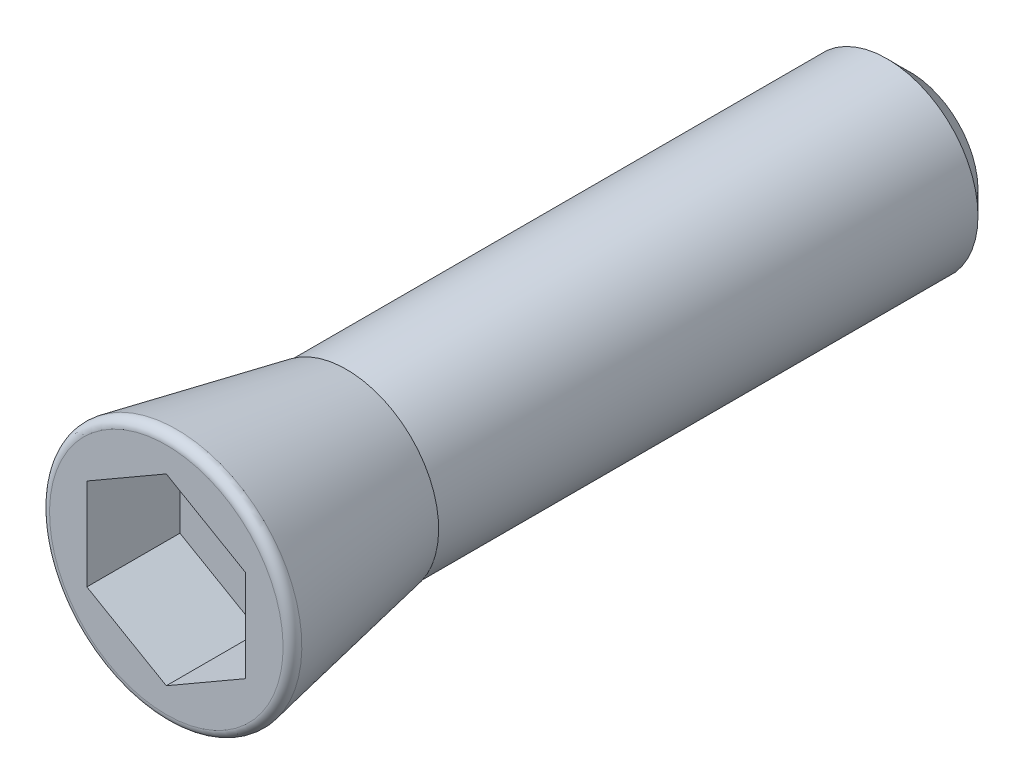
ISO-10303-21;
HEADER;
FILE_DESCRIPTION(('STEP AP214'),'2;1');
FILE_NAME('part.step','',(''),(''),'','','');
FILE_SCHEMA(('AUTOMOTIVE_DESIGN { 1 0 10303 214 1 1 1 1 }'));
ENDSEC;
DATA;
#1=APPLICATION_CONTEXT('core data for automotive mechanical design processes');
#2=APPLICATION_PROTOCOL_DEFINITION('international standard','automotive_design',2000,#1);
#3=PRODUCT_CONTEXT('',#1,'mechanical');
#4=PRODUCT('Part','Part','',(#3));
#5=PRODUCT_RELATED_PRODUCT_CATEGORY('part','',(#4));
#6=PRODUCT_DEFINITION_FORMATION('','',#4);
#7=PRODUCT_DEFINITION_CONTEXT('part definition',#1,'design');
#8=PRODUCT_DEFINITION('design','',#6,#7);
#9=PRODUCT_DEFINITION_SHAPE('','',#8);
#10=(LENGTH_UNIT() NAMED_UNIT(*) SI_UNIT(.MILLI.,.METRE.));
#11=(NAMED_UNIT(*) PLANE_ANGLE_UNIT() SI_UNIT($,.RADIAN.));
#12=(NAMED_UNIT(*) SI_UNIT($,.STERADIAN.) SOLID_ANGLE_UNIT());
#13=UNCERTAINTY_MEASURE_WITH_UNIT(LENGTH_MEASURE(1.E-05),#10,'distance_accuracy_value','');
#14=(GEOMETRIC_REPRESENTATION_CONTEXT(3) GLOBAL_UNCERTAINTY_ASSIGNED_CONTEXT((#13)) GLOBAL_UNIT_ASSIGNED_CONTEXT((#10,
#11,#12)) REPRESENTATION_CONTEXT('',''));
#15=CARTESIAN_POINT('',(0.,0.,0.));
#16=DIRECTION('',(0.,0.,1.));
#17=DIRECTION('',(1.,0.,0.));
#18=AXIS2_PLACEMENT_3D('',#15,#16,#17);
#19=CARTESIAN_POINT('',(0.,7.9375,-15.875));
#20=DIRECTION('',(0.,0.,1.));
#21=DIRECTION('',(0.,-1.,0.));
#22=AXIS2_PLACEMENT_3D('',#19,#20,#21);
#23=PLANE('',#22);
#24=CARTESIAN_POINT('',(0.,0.,-15.875));
#25=DIRECTION('',(0.,0.,1.));
#26=DIRECTION('',(0.,-1.,0.));
#27=AXIS2_PLACEMENT_3D('',#24,#25,#26);
#28=CIRCLE('',#27,8.);
#29=CARTESIAN_POINT('',(0.,-8.,-15.875));
#30=VERTEX_POINT('',#29);
#31=EDGE_CURVE('E132',#30,#30,#28,.T.);
#32=ORIENTED_EDGE('',*,*,#31,.T.);
#33=EDGE_LOOP('',(#32));
#34=FACE_BOUND('',#33,.T.);
#35=CARTESIAN_POINT('',(0.,0.,-15.875));
#36=DIRECTION('',(0.,0.,1.));
#37=DIRECTION('',(0.,-1.,0.));
#38=AXIS2_PLACEMENT_3D('',#35,#36,#37);
#39=CIRCLE('',#38,8.128);
#40=CARTESIAN_POINT('',(0.,-8.128,-15.875));
#41=VERTEX_POINT('',#40);
#42=EDGE_CURVE('E129',#41,#41,#39,.T.);
#43=ORIENTED_EDGE('',*,*,#42,.F.);
#44=EDGE_LOOP('',(#43));
#45=FACE_BOUND('',#44,.T.);
#46=ADVANCED_FACE('F14',(#34,#45),#23,.F.);
#47=CARTESIAN_POINT('',(0.,0.,-15.875));
#48=DIRECTION('',(0.,0.,1.));
#49=DIRECTION('',(0.,-1.,0.));
#50=AXIS2_PLACEMENT_3D('',#47,#48,#49);
#51=CONICAL_SURFACE('',#50,8.128,0.191986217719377);
#52=CARTESIAN_POINT('',(0.,0.,-0.907396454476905));
#53=DIRECTION('',(0.,0.,1.));
#54=DIRECTION('',(0.,-1.,0.));
#55=AXIS2_PLACEMENT_3D('',#52,#53,#54);
#56=CIRCLE('',#55,11.0374074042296);
#57=CARTESIAN_POINT('',(0.,-11.0374074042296,-0.907396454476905));
#58=VERTEX_POINT('',#57);
#59=EDGE_CURVE('E126',#58,#58,#56,.T.);
#60=ORIENTED_EDGE('',*,*,#59,.F.);
#61=EDGE_LOOP('',(#60));
#62=FACE_BOUND('',#61,.T.);
#63=ORIENTED_EDGE('',*,*,#42,.T.);
#64=EDGE_LOOP('',(#63));
#65=FACE_BOUND('',#64,.T.);
#66=ADVANCED_FACE('F149',(#62,#65),#51,.T.);
#67=CARTESIAN_POINT('',(0.,0.,-0.762000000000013));
#68=DIRECTION('',(0.,0.,1.));
#69=DIRECTION('',(0.,-1.,0.));
#70=AXIS2_PLACEMENT_3D('',#67,#68,#69);
#71=TOROIDAL_SURFACE('',#70,10.2894074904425,0.762);
#72=CARTESIAN_POINT('',(0.,0.,0.));
#73=DIRECTION('',(0.,0.,1.));
#74=DIRECTION('',(0.,-1.,0.));
#75=AXIS2_PLACEMENT_3D('',#72,#73,#74);
#76=CIRCLE('',#75,10.2894074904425);
#77=CARTESIAN_POINT('',(0.,-10.2894074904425,0.));
#78=VERTEX_POINT('',#77);
#79=EDGE_CURVE('E117',#78,#78,#76,.T.);
#80=ORIENTED_EDGE('',*,*,#79,.F.);
#81=EDGE_LOOP('',(#80));
#82=FACE_BOUND('',#81,.T.);
#83=ORIENTED_EDGE('',*,*,#59,.T.);
#84=EDGE_LOOP('',(#83));
#85=FACE_BOUND('',#84,.T.);
#86=ADVANCED_FACE('F156',(#82,#85),#71,.T.);
#87=CARTESIAN_POINT('',(0.,0.,0.));
#88=DIRECTION('',(0.,0.,-1.));
#89=DIRECTION('',(0.,1.,0.));
#90=AXIS2_PLACEMENT_3D('',#87,#88,#89);
#91=PLANE('',#90);
#92=DIRECTION('',(0.866025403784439,0.5,0.));
#93=VECTOR('',#92,1.);
#94=CARTESIAN_POINT('',(0.,-8.08290376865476,0.));
#95=LINE('',#94,#93);
#96=CARTESIAN_POINT('',(0.,-8.08290376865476,0.));
#97=VERTEX_POINT('',#96);
#98=CARTESIAN_POINT('',(7.,-4.04145188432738,0.));
#99=VERTEX_POINT('',#98);
#100=EDGE_CURVE('E83',#97,#99,#95,.T.);
#101=ORIENTED_EDGE('',*,*,#100,.F.);
#102=DIRECTION('',(0.866025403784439,-0.5,0.));
#103=VECTOR('',#102,1.);
#104=CARTESIAN_POINT('',(-7.,-4.04145188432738,0.));
#105=LINE('',#104,#103);
#106=CARTESIAN_POINT('',(-7.,-4.04145188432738,0.));
#107=VERTEX_POINT('',#106);
#108=EDGE_CURVE('E29',#107,#97,#105,.T.);
#109=ORIENTED_EDGE('',*,*,#108,.F.);
#110=DIRECTION('',(0.,-1.,0.));
#111=VECTOR('',#110,1.);
#112=CARTESIAN_POINT('',(-7.,4.04145188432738,0.));
#113=LINE('',#112,#111);
#114=CARTESIAN_POINT('',(-7.,4.04145188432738,0.));
#115=VERTEX_POINT('',#114);
#116=EDGE_CURVE('E99',#115,#107,#113,.T.);
#117=ORIENTED_EDGE('',*,*,#116,.F.);
#118=DIRECTION('',(-0.866025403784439,-0.5,0.));
#119=VECTOR('',#118,1.);
#120=CARTESIAN_POINT('',(0.,8.08290376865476,0.));
#121=LINE('',#120,#119);
#122=CARTESIAN_POINT('',(0.,8.08290376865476,0.));
#123=VERTEX_POINT('',#122);
#124=EDGE_CURVE('E93',#123,#115,#121,.T.);
#125=ORIENTED_EDGE('',*,*,#124,.F.);
#126=DIRECTION('',(-0.866025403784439,0.5,0.));
#127=VECTOR('',#126,1.);
#128=CARTESIAN_POINT('',(7.,4.04145188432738,0.));
#129=LINE('',#128,#127);
#130=CARTESIAN_POINT('',(7.,4.04145188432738,0.));
#131=VERTEX_POINT('',#130);
#132=EDGE_CURVE('E91',#131,#123,#129,.T.);
#133=ORIENTED_EDGE('',*,*,#132,.F.);
#134=DIRECTION('',(0.,1.,0.));
#135=VECTOR('',#134,1.);
#136=CARTESIAN_POINT('',(7.,-4.04145188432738,0.));
#137=LINE('',#136,#135);
#138=EDGE_CURVE('E72',#99,#131,#137,.T.);
#139=ORIENTED_EDGE('',*,*,#138,.F.);
#140=EDGE_LOOP('',(#101,#109,#117,#125,#133,#139));
#141=FACE_BOUND('',#140,.T.);
#142=ORIENTED_EDGE('',*,*,#79,.T.);
#143=EDGE_LOOP('',(#142));
#144=FACE_BOUND('',#143,.T.);
#145=ADVANCED_FACE('F87',(#141,#144),#91,.F.);
#146=CARTESIAN_POINT('',(-7.,-4.04145188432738,-8.2));
#147=DIRECTION('',(-0.5,-0.866025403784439,0.));
#148=DIRECTION('',(0.866025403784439,-0.5,0.));
#149=AXIS2_PLACEMENT_3D('',#146,#147,#148);
#150=PLANE('',#149);
#151=ORIENTED_EDGE('',*,*,#108,.T.);
#152=DIRECTION('',(0.,0.,1.));
#153=VECTOR('',#152,1.);
#154=CARTESIAN_POINT('',(0.,-8.08290376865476,-8.2));
#155=LINE('',#154,#153);
#156=CARTESIAN_POINT('',(0.,-8.08290376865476,-8.2));
#157=VERTEX_POINT('',#156);
#158=EDGE_CURVE('E80',#157,#97,#155,.T.);
#159=ORIENTED_EDGE('',*,*,#158,.F.);
#160=DIRECTION('',(0.866025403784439,-0.5,0.));
#161=VECTOR('',#160,1.);
#162=CARTESIAN_POINT('',(-7.,-4.04145188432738,-8.2));
#163=LINE('',#162,#161);
#164=CARTESIAN_POINT('',(-7.,-4.04145188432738,-8.2));
#165=VERTEX_POINT('',#164);
#166=EDGE_CURVE('E101',#165,#157,#163,.T.);
#167=ORIENTED_EDGE('',*,*,#166,.F.);
#168=DIRECTION('',(0.,0.,1.));
#169=VECTOR('',#168,1.);
#170=CARTESIAN_POINT('',(-7.,-4.04145188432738,-8.2));
#171=LINE('',#170,#169);
#172=EDGE_CURVE('E36',#165,#107,#171,.T.);
#173=ORIENTED_EDGE('',*,*,#172,.T.);
#174=EDGE_LOOP('',(#151,#159,#167,#173));
#175=FACE_BOUND('',#174,.T.);
#176=ADVANCED_FACE('F166',(#175),#150,.F.);
#177=CARTESIAN_POINT('',(-7.,4.04145188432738,-8.2));
#178=DIRECTION('',(-1.,0.,0.));
#179=DIRECTION('',(0.,-1.,0.));
#180=AXIS2_PLACEMENT_3D('',#177,#178,#179);
#181=PLANE('',#180);
#182=ORIENTED_EDGE('',*,*,#116,.T.);
#183=ORIENTED_EDGE('',*,*,#172,.F.);
#184=DIRECTION('',(0.,-1.,0.));
#185=VECTOR('',#184,1.);
#186=CARTESIAN_POINT('',(-7.,4.04145188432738,-8.2));
#187=LINE('',#186,#185);
#188=CARTESIAN_POINT('',(-7.,4.04145188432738,-8.2));
#189=VERTEX_POINT('',#188);
#190=EDGE_CURVE('E113',#189,#165,#187,.T.);
#191=ORIENTED_EDGE('',*,*,#190,.F.);
#192=DIRECTION('',(0.,0.,1.));
#193=VECTOR('',#192,1.);
#194=CARTESIAN_POINT('',(-7.,4.04145188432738,-8.2));
#195=LINE('',#194,#193);
#196=EDGE_CURVE('E118',#189,#115,#195,.T.);
#197=ORIENTED_EDGE('',*,*,#196,.T.);
#198=EDGE_LOOP('',(#182,#183,#191,#197));
#199=FACE_BOUND('',#198,.T.);
#200=ADVANCED_FACE('F169',(#199),#181,.F.);
#201=CARTESIAN_POINT('',(0.,8.08290376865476,-8.2));
#202=DIRECTION('',(-0.5,0.866025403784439,0.));
#203=DIRECTION('',(-0.866025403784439,-0.5,0.));
#204=AXIS2_PLACEMENT_3D('',#201,#202,#203);
#205=PLANE('',#204);
#206=ORIENTED_EDGE('',*,*,#124,.T.);
#207=ORIENTED_EDGE('',*,*,#196,.F.);
#208=DIRECTION('',(-0.866025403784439,-0.5,0.));
#209=VECTOR('',#208,1.);
#210=CARTESIAN_POINT('',(0.,8.08290376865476,-8.2));
#211=LINE('',#210,#209);
#212=CARTESIAN_POINT('',(0.,8.08290376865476,-8.2));
#213=VERTEX_POINT('',#212);
#214=EDGE_CURVE('E110',#213,#189,#211,.T.);
#215=ORIENTED_EDGE('',*,*,#214,.F.);
#216=DIRECTION('',(0.,0.,1.));
#217=VECTOR('',#216,1.);
#218=CARTESIAN_POINT('',(0.,8.08290376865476,-8.2));
#219=LINE('',#218,#217);
#220=EDGE_CURVE('E120',#213,#123,#219,.T.);
#221=ORIENTED_EDGE('',*,*,#220,.T.);
#222=EDGE_LOOP('',(#206,#207,#215,#221));
#223=FACE_BOUND('',#222,.T.);
#224=ADVANCED_FACE('F178',(#223),#205,.F.);
#225=CARTESIAN_POINT('',(7.,4.04145188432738,-8.2));
#226=DIRECTION('',(0.5,0.866025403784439,0.));
#227=DIRECTION('',(-0.866025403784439,0.5,0.));
#228=AXIS2_PLACEMENT_3D('',#225,#226,#227);
#229=PLANE('',#228);
#230=ORIENTED_EDGE('',*,*,#132,.T.);
#231=ORIENTED_EDGE('',*,*,#220,.F.);
#232=DIRECTION('',(-0.866025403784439,0.5,0.));
#233=VECTOR('',#232,1.);
#234=CARTESIAN_POINT('',(7.,4.04145188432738,-8.2));
#235=LINE('',#234,#233);
#236=CARTESIAN_POINT('',(7.,4.04145188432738,-8.2));
#237=VERTEX_POINT('',#236);
#238=EDGE_CURVE('E107',#237,#213,#235,.T.);
#239=ORIENTED_EDGE('',*,*,#238,.F.);
#240=DIRECTION('',(0.,0.,1.));
#241=VECTOR('',#240,1.);
#242=CARTESIAN_POINT('',(7.,4.04145188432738,-8.2));
#243=LINE('',#242,#241);
#244=EDGE_CURVE('E79',#237,#131,#243,.T.);
#245=ORIENTED_EDGE('',*,*,#244,.T.);
#246=EDGE_LOOP('',(#230,#231,#239,#245));
#247=FACE_BOUND('',#246,.T.);
#248=ADVANCED_FACE('F175',(#247),#229,.F.);
#249=CARTESIAN_POINT('',(7.,-4.04145188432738,-8.2));
#250=DIRECTION('',(1.,0.,0.));
#251=DIRECTION('',(0.,1.,0.));
#252=AXIS2_PLACEMENT_3D('',#249,#250,#251);
#253=PLANE('',#252);
#254=ORIENTED_EDGE('',*,*,#138,.T.);
#255=ORIENTED_EDGE('',*,*,#244,.F.);
#256=DIRECTION('',(0.,1.,0.));
#257=VECTOR('',#256,1.);
#258=CARTESIAN_POINT('',(7.,-4.04145188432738,-8.2));
#259=LINE('',#258,#257);
#260=CARTESIAN_POINT('',(7.,-4.04145188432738,-8.2));
#261=VERTEX_POINT('',#260);
#262=EDGE_CURVE('E75',#261,#237,#259,.T.);
#263=ORIENTED_EDGE('',*,*,#262,.F.);
#264=DIRECTION('',(0.,0.,1.));
#265=VECTOR('',#264,1.);
#266=CARTESIAN_POINT('',(7.,-4.04145188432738,-8.2));
#267=LINE('',#266,#265);
#268=EDGE_CURVE('E68',#261,#99,#267,.T.);
#269=ORIENTED_EDGE('',*,*,#268,.T.);
#270=EDGE_LOOP('',(#254,#255,#263,#269));
#271=FACE_BOUND('',#270,.T.);
#272=ADVANCED_FACE('F70',(#271),#253,.F.);
#273=CARTESIAN_POINT('',(0.,-8.08290376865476,-8.2));
#274=DIRECTION('',(0.5,-0.866025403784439,0.));
#275=DIRECTION('',(0.866025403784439,0.5,0.));
#276=AXIS2_PLACEMENT_3D('',#273,#274,#275);
#277=PLANE('',#276);
#278=ORIENTED_EDGE('',*,*,#100,.T.);
#279=ORIENTED_EDGE('',*,*,#268,.F.);
#280=DIRECTION('',(0.866025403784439,0.5,0.));
#281=VECTOR('',#280,1.);
#282=CARTESIAN_POINT('',(0.,-8.08290376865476,-8.2));
#283=LINE('',#282,#281);
#284=EDGE_CURVE('E104',#157,#261,#283,.T.);
#285=ORIENTED_EDGE('',*,*,#284,.F.);
#286=ORIENTED_EDGE('',*,*,#158,.T.);
#287=EDGE_LOOP('',(#278,#279,#285,#286));
#288=FACE_BOUND('',#287,.T.);
#289=ADVANCED_FACE('F84',(#288),#277,.F.);
#290=CARTESIAN_POINT('',(-7.,-4.04145188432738,-8.2));
#291=DIRECTION('',(0.,0.,-1.));
#292=DIRECTION('',(-1.,0.,0.));
#293=AXIS2_PLACEMENT_3D('',#290,#291,#292);
#294=PLANE('',#293);
#295=ORIENTED_EDGE('',*,*,#166,.T.);
#296=ORIENTED_EDGE('',*,*,#284,.T.);
#297=ORIENTED_EDGE('',*,*,#262,.T.);
#298=ORIENTED_EDGE('',*,*,#238,.T.);
#299=ORIENTED_EDGE('',*,*,#214,.T.);
#300=ORIENTED_EDGE('',*,*,#190,.T.);
#301=EDGE_LOOP('',(#295,#296,#297,#298,#299,#300));
#302=FACE_BOUND('',#301,.T.);
#303=ADVANCED_FACE('F172',(#302),#294,.F.);
#304=CARTESIAN_POINT('',(0.,0.,-10.532));
#305=DIRECTION('',(0.,0.,-1.));
#306=DIRECTION('',(0.,1.,0.));
#307=AXIS2_PLACEMENT_3D('',#304,#305,#306);
#308=CYLINDRICAL_SURFACE('',#307,8.);
#309=CARTESIAN_POINT('',(0.,0.,-63.532));
#310=DIRECTION('',(0.,0.,1.));
#311=DIRECTION('',(0.,-1.,0.));
#312=AXIS2_PLACEMENT_3D('',#309,#310,#311);
#313=CIRCLE('',#312,8.);
#314=CARTESIAN_POINT('',(0.,-8.,-63.532));
#315=VERTEX_POINT('',#314);
#316=EDGE_CURVE('E9',#315,#315,#313,.T.);
#317=ORIENTED_EDGE('',*,*,#316,.T.);
#318=EDGE_LOOP('',(#317));
#319=FACE_BOUND('',#318,.T.);
#320=ORIENTED_EDGE('',*,*,#31,.F.);
#321=EDGE_LOOP('',(#320));
#322=FACE_BOUND('',#321,.T.);
#323=ADVANCED_FACE('F146',(#319,#322),#308,.T.);
#324=CARTESIAN_POINT('',(0.,0.,-65.532));
#325=DIRECTION('',(0.,0.,1.));
#326=DIRECTION('',(0.,-1.,0.));
#327=AXIS2_PLACEMENT_3D('',#324,#325,#326);
#328=PLANE('',#327);
#329=CARTESIAN_POINT('',(0.,0.,-65.532));
#330=DIRECTION('',(0.,0.,1.));
#331=DIRECTION('',(0.,-1.,0.));
#332=AXIS2_PLACEMENT_3D('',#329,#330,#331);
#333=CIRCLE('',#332,6.);
#334=CARTESIAN_POINT('',(0.,-6.,-65.532));
#335=VERTEX_POINT('',#334);
#336=EDGE_CURVE('E22',#335,#335,#333,.F.);
#337=ORIENTED_EDGE('',*,*,#336,.T.);
#338=EDGE_LOOP('',(#337));
#339=FACE_BOUND('',#338,.T.);
#340=ADVANCED_FACE('F137',(#339),#328,.F.);
#341=CARTESIAN_POINT('',(0.,0.,-65.532));
#342=DIRECTION('',(0.,0.,1.));
#343=DIRECTION('',(0.,-1.,0.));
#344=AXIS2_PLACEMENT_3D('',#341,#342,#343);
#345=CONICAL_SURFACE('',#344,6.,0.785398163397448);
#346=ORIENTED_EDGE('',*,*,#316,.F.);
#347=EDGE_LOOP('',(#346));
#348=FACE_BOUND('',#347,.T.);
#349=ORIENTED_EDGE('',*,*,#336,.F.);
#350=EDGE_LOOP('',(#349));
#351=FACE_BOUND('',#350,.T.);
#352=ADVANCED_FACE('F16',(#348,#351),#345,.T.);
#353=CLOSED_SHELL('',(#46,#66,#86,#145,#176,#200,#224,#248,#272,#289,#303,#323,#340,#352));
#354=MANIFOLD_SOLID_BREP('B1',#353);
#355=ADVANCED_BREP_SHAPE_REPRESENTATION('',(#18,#354),#14);
#356=SHAPE_DEFINITION_REPRESENTATION(#9,#355);
ENDSEC;
END-ISO-10303-21;
